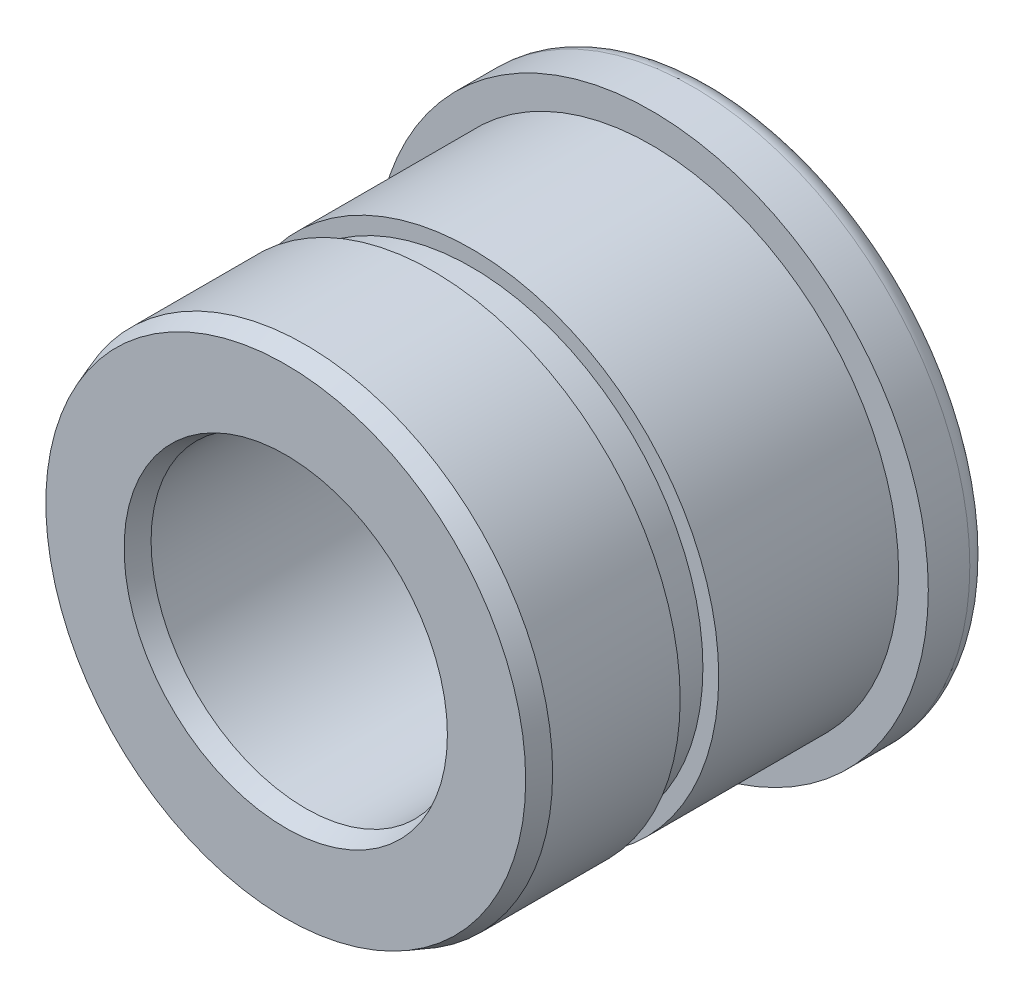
from build123d import *

# Parameters (mm, degrees)
SKETCH1_R                      = 7.112
BOSS_EXTRUDE1_DEPTH            = 1.5748
SKETCH2_R                      = 6.35
BOSS_EXTRUDE2_DEPTH            = 4.6228
SKETCH5_R                      = 5.9436
BOSS_EXTRUDE3_DEPTH            = 0.9906
SKETCH6_R                      = 6.35
BOSS_EXTRUDE4_DEPTH            = 3.7846
F_5_16_0_3125_DIAMETER_HOLE1_D = 7.9375
FILLET1_R                      = 0.508
CHAMFER1_SIZE                  = 0.508
CHAMFER1_SIZE2                 = 0.184896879
CHAMFER3_SIZE                  = 0.508
CHAMFER3_SIZE2                 = 0.184896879
CHAMFER4_SIZE                  = 0.508
CHAMFER4_SIZE2                 = 0.184896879


with BuildPart() as part:
    # Sketch1 → Boss-Extrude1 (new body)
    with BuildSketch(Plane.XY):
        Circle(SKETCH1_R)
    extrude(amount=BOSS_EXTRUDE1_DEPTH)

    # Sketch2 → Boss-Extrude2 (add)
    with BuildSketch(Plane.XY.offset(1.5748)):
        Circle(SKETCH2_R)
    extrude(amount=BOSS_EXTRUDE2_DEPTH)

    # Sketch5 → Boss-Extrude3 (add)
    with BuildSketch(Plane.XY.offset(6.1976)):
        Circle(SKETCH5_R)
    extrude(amount=BOSS_EXTRUDE3_DEPTH)

    # Sketch6 → Boss-Extrude4 (add)
    with BuildSketch(Plane.XY.offset(7.1882)):
        Circle(SKETCH6_R)
    extrude(amount=BOSS_EXTRUDE4_DEPTH)

    # 5_16 _0.3125_ Diameter Hole1 (through all)
    with Locations(Plane(origin=(0, 0, 0), x_dir=(-1, 0, 0), z_dir=(0, 0, -1))):
        with Locations((0, 0)):
            Hole(F_5_16_0_3125_DIAMETER_HOLE1_D / 2)

    # Fillet1
    fillet1_edges = [part.edges().sort_by_distance(p)[0] for p in [
        (-7.112, 0, 0),
    ]]
    fillet(fillet1_edges, radius=FILLET1_R)

    # Chamfer1
    chamfer1_edges = [part.edges().sort_by_distance(p)[0] for p in [
        (-3.96875, 0, 0),
    ]]
    chamfer1_side = [part.faces().sort_by_distance(p)[0] for p in [
        (-3.96875, 0, 5.4864),
    ]]
    chamfer(chamfer1_edges, length=CHAMFER1_SIZE, length2=CHAMFER1_SIZE2, reference=chamfer1_side[0])

    # Chamfer3
    chamfer3_edges = [part.edges().sort_by_distance(p)[0] for p in [
        (-3.96875, 0, 10.9728),
    ]]
    chamfer3_side = [part.faces().sort_by_distance(p)[0] for p in [
        (-3.96875, 0, 5.7404),
    ]]
    chamfer(chamfer3_edges, length=CHAMFER3_SIZE, length2=CHAMFER3_SIZE2, reference=chamfer3_side[0])

    # Chamfer4
    chamfer4_edges = [part.edges().sort_by_distance(p)[0] for p in [
        (-6.35, 0, 10.9728),
    ]]
    chamfer4_side = [part.faces().sort_by_distance(p)[0] for p in [
        (-6.35, 0, 9.0805),
    ]]
    chamfer(chamfer4_edges, length=CHAMFER4_SIZE, length2=CHAMFER4_SIZE2, reference=chamfer4_side[0])


solid = part.part
